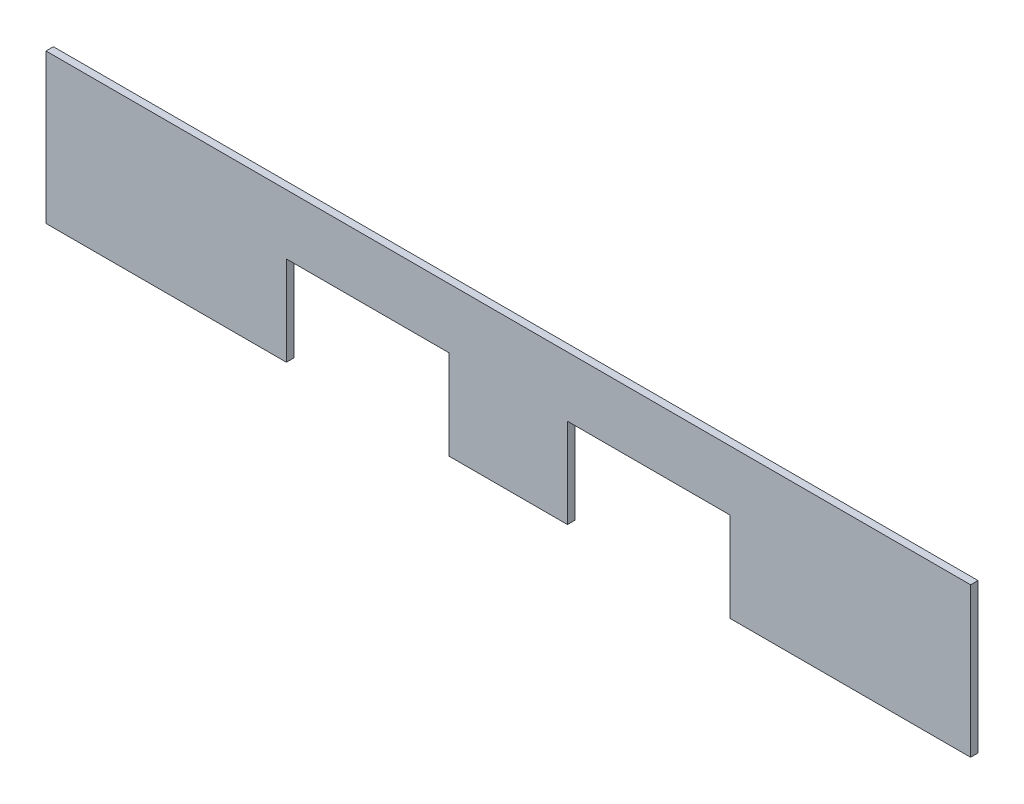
ISO-10303-21;
HEADER;
FILE_DESCRIPTION(('STEP AP214'),'2;1');
FILE_NAME('part.step','',(''),(''),'','','');
FILE_SCHEMA(('AUTOMOTIVE_DESIGN { 1 0 10303 214 1 1 1 1 }'));
ENDSEC;
DATA;
#1=APPLICATION_CONTEXT('core data for automotive mechanical design processes');
#2=APPLICATION_PROTOCOL_DEFINITION('international standard','automotive_design',2000,#1);
#3=PRODUCT_CONTEXT('',#1,'mechanical');
#4=PRODUCT('Part','Part','',(#3));
#5=PRODUCT_RELATED_PRODUCT_CATEGORY('part','',(#4));
#6=PRODUCT_DEFINITION_FORMATION('','',#4);
#7=PRODUCT_DEFINITION_CONTEXT('part definition',#1,'design');
#8=PRODUCT_DEFINITION('design','',#6,#7);
#9=PRODUCT_DEFINITION_SHAPE('','',#8);
#10=(LENGTH_UNIT() NAMED_UNIT(*) SI_UNIT(.MILLI.,.METRE.));
#11=(NAMED_UNIT(*) PLANE_ANGLE_UNIT() SI_UNIT($,.RADIAN.));
#12=(NAMED_UNIT(*) SI_UNIT($,.STERADIAN.) SOLID_ANGLE_UNIT());
#13=UNCERTAINTY_MEASURE_WITH_UNIT(LENGTH_MEASURE(1.E-05),#10,'distance_accuracy_value','');
#14=(GEOMETRIC_REPRESENTATION_CONTEXT(3) GLOBAL_UNCERTAINTY_ASSIGNED_CONTEXT((#13)) GLOBAL_UNIT_ASSIGNED_CONTEXT((#10,
#11,#12)) REPRESENTATION_CONTEXT('',''));
#15=CARTESIAN_POINT('',(0.,0.,0.));
#16=DIRECTION('',(0.,0.,1.));
#17=DIRECTION('',(1.,0.,0.));
#18=AXIS2_PLACEMENT_3D('',#15,#16,#17);
#19=CARTESIAN_POINT('',(625.,200.,200.));
#20=DIRECTION('',(0.,0.,-1.));
#21=DIRECTION('',(-1.,0.,0.));
#22=AXIS2_PLACEMENT_3D('',#19,#20,#21);
#23=PLANE('',#22);
#24=DIRECTION('',(0.,1.,0.));
#25=VECTOR('',#24,1.);
#26=CARTESIAN_POINT('',(-80.,0.,200.));
#27=LINE('',#26,#25);
#28=CARTESIAN_POINT('',(-80.,-1.,200.));
#29=VERTEX_POINT('',#28);
#30=CARTESIAN_POINT('',(-80.,120.,200.));
#31=VERTEX_POINT('',#30);
#32=EDGE_CURVE('E187',#29,#31,#27,.T.);
#33=ORIENTED_EDGE('',*,*,#32,.F.);
#34=DIRECTION('',(-1.,0.,0.));
#35=VECTOR('',#34,1.);
#36=CARTESIAN_POINT('',(80.,-1.,200.));
#37=LINE('',#36,#35);
#38=CARTESIAN_POINT('',(80.,-1.,200.));
#39=VERTEX_POINT('',#38);
#40=EDGE_CURVE('E151',#39,#29,#37,.T.);
#41=ORIENTED_EDGE('',*,*,#40,.F.);
#42=DIRECTION('',(0.,-1.,0.));
#43=VECTOR('',#42,1.);
#44=CARTESIAN_POINT('',(80.,120.,200.));
#45=LINE('',#44,#43);
#46=CARTESIAN_POINT('',(80.,120.,200.));
#47=VERTEX_POINT('',#46);
#48=EDGE_CURVE('E199',#47,#39,#45,.T.);
#49=ORIENTED_EDGE('',*,*,#48,.F.);
#50=DIRECTION('',(-1.,0.,0.));
#51=VECTOR('',#50,1.);
#52=CARTESIAN_POINT('',(300.,120.,200.));
#53=LINE('',#52,#51);
#54=CARTESIAN_POINT('',(300.,120.,200.));
#55=VERTEX_POINT('',#54);
#56=EDGE_CURVE('E197',#55,#47,#53,.T.);
#57=ORIENTED_EDGE('',*,*,#56,.F.);
#58=DIRECTION('',(0.,1.,0.));
#59=VECTOR('',#58,1.);
#60=CARTESIAN_POINT('',(300.,0.,200.));
#61=LINE('',#60,#59);
#62=CARTESIAN_POINT('',(300.,-1.,200.));
#63=VERTEX_POINT('',#62);
#64=EDGE_CURVE('E201',#63,#55,#61,.T.);
#65=ORIENTED_EDGE('',*,*,#64,.F.);
#66=DIRECTION('',(-1.,0.,0.));
#67=VECTOR('',#66,1.);
#68=CARTESIAN_POINT('',(625.,-1.,200.));
#69=LINE('',#68,#67);
#70=CARTESIAN_POINT('',(625.,-1.,200.));
#71=VERTEX_POINT('',#70);
#72=EDGE_CURVE('E163',#71,#63,#69,.T.);
#73=ORIENTED_EDGE('',*,*,#72,.F.);
#74=DIRECTION('',(0.,-1.,0.));
#75=VECTOR('',#74,1.);
#76=CARTESIAN_POINT('',(625.,200.,200.));
#77=LINE('',#76,#75);
#78=CARTESIAN_POINT('',(625.,201.,200.));
#79=VERTEX_POINT('',#78);
#80=EDGE_CURVE('E207',#79,#71,#77,.T.);
#81=ORIENTED_EDGE('',*,*,#80,.F.);
#82=DIRECTION('',(1.,0.,0.));
#83=VECTOR('',#82,1.);
#84=CARTESIAN_POINT('',(-625.,201.,200.));
#85=LINE('',#84,#83);
#86=CARTESIAN_POINT('',(-625.,201.,200.));
#87=VERTEX_POINT('',#86);
#88=EDGE_CURVE('E184',#87,#79,#85,.T.);
#89=ORIENTED_EDGE('',*,*,#88,.F.);
#90=DIRECTION('',(0.,-1.,0.));
#91=VECTOR('',#90,1.);
#92=CARTESIAN_POINT('',(-625.,200.,200.));
#93=LINE('',#92,#91);
#94=CARTESIAN_POINT('',(-625.,-1.,200.));
#95=VERTEX_POINT('',#94);
#96=EDGE_CURVE('E206',#87,#95,#93,.T.);
#97=ORIENTED_EDGE('',*,*,#96,.T.);
#98=DIRECTION('',(-1.,0.,0.));
#99=VECTOR('',#98,1.);
#100=CARTESIAN_POINT('',(-300.,-1.,200.));
#101=LINE('',#100,#99);
#102=CARTESIAN_POINT('',(-300.,-1.,200.));
#103=VERTEX_POINT('',#102);
#104=EDGE_CURVE('E141',#103,#95,#101,.T.);
#105=ORIENTED_EDGE('',*,*,#104,.F.);
#106=DIRECTION('',(0.,-1.,0.));
#107=VECTOR('',#106,1.);
#108=CARTESIAN_POINT('',(-300.,120.,200.));
#109=LINE('',#108,#107);
#110=CARTESIAN_POINT('',(-300.,120.,200.));
#111=VERTEX_POINT('',#110);
#112=EDGE_CURVE('E137',#111,#103,#109,.T.);
#113=ORIENTED_EDGE('',*,*,#112,.F.);
#114=DIRECTION('',(-1.,0.,0.));
#115=VECTOR('',#114,1.);
#116=CARTESIAN_POINT('',(-80.,120.,200.));
#117=LINE('',#116,#115);
#118=EDGE_CURVE('E189',#31,#111,#117,.T.);
#119=ORIENTED_EDGE('',*,*,#118,.F.);
#120=EDGE_LOOP('',(#33,#41,#49,#57,#65,#73,#81,#89,#97,#105,#113,#119));
#121=FACE_BOUND('',#120,.T.);
#122=ADVANCED_FACE('F35',(#121),#23,.F.);
#123=CARTESIAN_POINT('',(625.,190.,190.));
#124=DIRECTION('',(0.,0.,-1.));
#125=DIRECTION('',(-1.,0.,0.));
#126=AXIS2_PLACEMENT_3D('',#123,#124,#125);
#127=PLANE('',#126);
#128=DIRECTION('',(0.,-1.,0.));
#129=VECTOR('',#128,1.);
#130=CARTESIAN_POINT('',(80.,190.,190.));
#131=LINE('',#130,#129);
#132=CARTESIAN_POINT('',(80.,120.,190.));
#133=VERTEX_POINT('',#132);
#134=CARTESIAN_POINT('',(80.,-1.,190.));
#135=VERTEX_POINT('',#134);
#136=EDGE_CURVE('E57',#133,#135,#131,.T.);
#137=ORIENTED_EDGE('',*,*,#136,.T.);
#138=DIRECTION('',(1.,0.,0.));
#139=VECTOR('',#138,1.);
#140=CARTESIAN_POINT('',(-80.,-1.,190.));
#141=LINE('',#140,#139);
#142=CARTESIAN_POINT('',(-80.,-1.,190.));
#143=VERTEX_POINT('',#142);
#144=EDGE_CURVE('E157',#143,#135,#141,.T.);
#145=ORIENTED_EDGE('',*,*,#144,.F.);
#146=DIRECTION('',(0.,1.,0.));
#147=VECTOR('',#146,1.);
#148=CARTESIAN_POINT('',(-80.,190.,190.));
#149=LINE('',#148,#147);
#150=CARTESIAN_POINT('',(-80.,120.,190.));
#151=VERTEX_POINT('',#150);
#152=EDGE_CURVE('E11',#143,#151,#149,.T.);
#153=ORIENTED_EDGE('',*,*,#152,.T.);
#154=DIRECTION('',(-1.,0.,0.));
#155=VECTOR('',#154,1.);
#156=CARTESIAN_POINT('',(625.,120.,190.));
#157=LINE('',#156,#155);
#158=CARTESIAN_POINT('',(-300.,120.,190.));
#159=VERTEX_POINT('',#158);
#160=EDGE_CURVE('E42',#151,#159,#157,.T.);
#161=ORIENTED_EDGE('',*,*,#160,.T.);
#162=DIRECTION('',(0.,-1.,0.));
#163=VECTOR('',#162,1.);
#164=CARTESIAN_POINT('',(-300.,190.,190.));
#165=LINE('',#164,#163);
#166=CARTESIAN_POINT('',(-300.,-1.,190.));
#167=VERTEX_POINT('',#166);
#168=EDGE_CURVE('E124',#159,#167,#165,.T.);
#169=ORIENTED_EDGE('',*,*,#168,.T.);
#170=DIRECTION('',(1.,0.,0.));
#171=VECTOR('',#170,1.);
#172=CARTESIAN_POINT('',(-625.,-1.,190.));
#173=LINE('',#172,#171);
#174=CARTESIAN_POINT('',(-625.,-1.,190.));
#175=VERTEX_POINT('',#174);
#176=EDGE_CURVE('E128',#175,#167,#173,.T.);
#177=ORIENTED_EDGE('',*,*,#176,.F.);
#178=DIRECTION('',(0.,1.,0.));
#179=VECTOR('',#178,1.);
#180=CARTESIAN_POINT('',(-625.,0.,190.));
#181=LINE('',#180,#179);
#182=CARTESIAN_POINT('',(-625.,201.,190.));
#183=VERTEX_POINT('',#182);
#184=EDGE_CURVE('E211',#175,#183,#181,.T.);
#185=ORIENTED_EDGE('',*,*,#184,.T.);
#186=DIRECTION('',(-1.,0.,0.));
#187=VECTOR('',#186,1.);
#188=CARTESIAN_POINT('',(625.,201.,190.));
#189=LINE('',#188,#187);
#190=CARTESIAN_POINT('',(625.,201.,190.));
#191=VERTEX_POINT('',#190);
#192=EDGE_CURVE('E178',#191,#183,#189,.T.);
#193=ORIENTED_EDGE('',*,*,#192,.F.);
#194=DIRECTION('',(0.,1.,0.));
#195=VECTOR('',#194,1.);
#196=CARTESIAN_POINT('',(625.,0.,190.));
#197=LINE('',#196,#195);
#198=CARTESIAN_POINT('',(625.,-1.,190.));
#199=VERTEX_POINT('',#198);
#200=EDGE_CURVE('E209',#199,#191,#197,.T.);
#201=ORIENTED_EDGE('',*,*,#200,.F.);
#202=DIRECTION('',(1.,0.,0.));
#203=VECTOR('',#202,1.);
#204=CARTESIAN_POINT('',(300.,-1.,190.));
#205=LINE('',#204,#203);
#206=CARTESIAN_POINT('',(300.,-1.,190.));
#207=VERTEX_POINT('',#206);
#208=EDGE_CURVE('E169',#207,#199,#205,.T.);
#209=ORIENTED_EDGE('',*,*,#208,.F.);
#210=DIRECTION('',(0.,1.,0.));
#211=VECTOR('',#210,1.);
#212=CARTESIAN_POINT('',(300.,190.,190.));
#213=LINE('',#212,#211);
#214=CARTESIAN_POINT('',(300.,120.,190.));
#215=VERTEX_POINT('',#214);
#216=EDGE_CURVE('E213',#207,#215,#213,.T.);
#217=ORIENTED_EDGE('',*,*,#216,.T.);
#218=DIRECTION('',(-1.,0.,0.));
#219=VECTOR('',#218,1.);
#220=CARTESIAN_POINT('',(625.,120.,190.));
#221=LINE('',#220,#219);
#222=EDGE_CURVE('E217',#215,#133,#221,.T.);
#223=ORIENTED_EDGE('',*,*,#222,.T.);
#224=EDGE_LOOP('',(#137,#145,#153,#161,#169,#177,#185,#193,#201,#209,#217,#223));
#225=FACE_BOUND('',#224,.T.);
#226=ADVANCED_FACE('F126',(#225),#127,.T.);
#227=CARTESIAN_POINT('',(625.,0.,200.));
#228=DIRECTION('',(1.,0.,0.));
#229=DIRECTION('',(0.,0.,-1.));
#230=AXIS2_PLACEMENT_3D('',#227,#228,#229);
#231=PLANE('',#230);
#232=ORIENTED_EDGE('',*,*,#80,.T.);
#233=DIRECTION('',(0.,0.,1.));
#234=VECTOR('',#233,1.);
#235=CARTESIAN_POINT('',(625.,-1.,190.));
#236=LINE('',#235,#234);
#237=EDGE_CURVE('E172',#199,#71,#236,.T.);
#238=ORIENTED_EDGE('',*,*,#237,.F.);
#239=ORIENTED_EDGE('',*,*,#200,.T.);
#240=DIRECTION('',(0.,0.,-1.));
#241=VECTOR('',#240,1.);
#242=CARTESIAN_POINT('',(625.,201.,200.));
#243=LINE('',#242,#241);
#244=EDGE_CURVE('E175',#79,#191,#243,.T.);
#245=ORIENTED_EDGE('',*,*,#244,.F.);
#246=EDGE_LOOP('',(#232,#238,#239,#245));
#247=FACE_BOUND('',#246,.T.);
#248=ADVANCED_FACE('F244',(#247),#231,.T.);
#249=CARTESIAN_POINT('',(-625.,0.,200.));
#250=DIRECTION('',(1.,0.,0.));
#251=DIRECTION('',(0.,0.,-1.));
#252=AXIS2_PLACEMENT_3D('',#249,#250,#251);
#253=PLANE('',#252);
#254=ORIENTED_EDGE('',*,*,#184,.F.);
#255=DIRECTION('',(0.,0.,-1.));
#256=VECTOR('',#255,1.);
#257=CARTESIAN_POINT('',(-625.,-1.,200.));
#258=LINE('',#257,#256);
#259=EDGE_CURVE('E146',#95,#175,#258,.T.);
#260=ORIENTED_EDGE('',*,*,#259,.F.);
#261=ORIENTED_EDGE('',*,*,#96,.F.);
#262=DIRECTION('',(0.,0.,1.));
#263=VECTOR('',#262,1.);
#264=CARTESIAN_POINT('',(-625.,201.,190.));
#265=LINE('',#264,#263);
#266=EDGE_CURVE('E181',#183,#87,#265,.T.);
#267=ORIENTED_EDGE('',*,*,#266,.F.);
#268=EDGE_LOOP('',(#254,#260,#261,#267));
#269=FACE_BOUND('',#268,.T.);
#270=ADVANCED_FACE('F237',(#269),#253,.F.);
#271=CARTESIAN_POINT('',(300.,120.,200.));
#272=DIRECTION('',(0.,-1.,0.));
#273=DIRECTION('',(0.,0.,-1.));
#274=AXIS2_PLACEMENT_3D('',#271,#272,#273);
#275=PLANE('',#274);
#276=DIRECTION('',(0.,0.,-1.));
#277=VECTOR('',#276,1.);
#278=CARTESIAN_POINT('',(300.,120.,200.));
#279=LINE('',#278,#277);
#280=EDGE_CURVE('E49',#55,#215,#279,.T.);
#281=ORIENTED_EDGE('',*,*,#280,.F.);
#282=ORIENTED_EDGE('',*,*,#56,.T.);
#283=DIRECTION('',(0.,0.,-1.));
#284=VECTOR('',#283,1.);
#285=CARTESIAN_POINT('',(80.,120.,200.));
#286=LINE('',#285,#284);
#287=EDGE_CURVE('E204',#47,#133,#286,.T.);
#288=ORIENTED_EDGE('',*,*,#287,.T.);
#289=ORIENTED_EDGE('',*,*,#222,.F.);
#290=EDGE_LOOP('',(#281,#282,#288,#289));
#291=FACE_BOUND('',#290,.T.);
#292=ADVANCED_FACE('F253',(#291),#275,.T.);
#293=CARTESIAN_POINT('',(80.,120.,200.));
#294=DIRECTION('',(1.,0.,0.));
#295=DIRECTION('',(0.,0.,-1.));
#296=AXIS2_PLACEMENT_3D('',#293,#294,#295);
#297=PLANE('',#296);
#298=ORIENTED_EDGE('',*,*,#287,.F.);
#299=ORIENTED_EDGE('',*,*,#48,.T.);
#300=DIRECTION('',(0.,0.,1.));
#301=VECTOR('',#300,1.);
#302=CARTESIAN_POINT('',(80.,-1.,190.));
#303=LINE('',#302,#301);
#304=EDGE_CURVE('E160',#135,#39,#303,.T.);
#305=ORIENTED_EDGE('',*,*,#304,.F.);
#306=ORIENTED_EDGE('',*,*,#136,.F.);
#307=EDGE_LOOP('',(#298,#299,#305,#306));
#308=FACE_BOUND('',#307,.T.);
#309=ADVANCED_FACE('F225',(#308),#297,.T.);
#310=CARTESIAN_POINT('',(300.,0.,200.));
#311=DIRECTION('',(-1.,0.,0.));
#312=DIRECTION('',(0.,0.,1.));
#313=AXIS2_PLACEMENT_3D('',#310,#311,#312);
#314=PLANE('',#313);
#315=ORIENTED_EDGE('',*,*,#216,.F.);
#316=DIRECTION('',(0.,0.,-1.));
#317=VECTOR('',#316,1.);
#318=CARTESIAN_POINT('',(300.,-1.,200.));
#319=LINE('',#318,#317);
#320=EDGE_CURVE('E166',#63,#207,#319,.T.);
#321=ORIENTED_EDGE('',*,*,#320,.F.);
#322=ORIENTED_EDGE('',*,*,#64,.T.);
#323=ORIENTED_EDGE('',*,*,#280,.T.);
#324=EDGE_LOOP('',(#315,#321,#322,#323));
#325=FACE_BOUND('',#324,.T.);
#326=ADVANCED_FACE('F251',(#325),#314,.T.);
#327=CARTESIAN_POINT('',(-80.,0.,200.));
#328=DIRECTION('',(-1.,0.,0.));
#329=DIRECTION('',(0.,0.,1.));
#330=AXIS2_PLACEMENT_3D('',#327,#328,#329);
#331=PLANE('',#330);
#332=ORIENTED_EDGE('',*,*,#152,.F.);
#333=DIRECTION('',(0.,0.,-1.));
#334=VECTOR('',#333,1.);
#335=CARTESIAN_POINT('',(-80.,-1.,200.));
#336=LINE('',#335,#334);
#337=EDGE_CURVE('E154',#29,#143,#336,.T.);
#338=ORIENTED_EDGE('',*,*,#337,.F.);
#339=ORIENTED_EDGE('',*,*,#32,.T.);
#340=DIRECTION('',(0.,0.,-1.));
#341=VECTOR('',#340,1.);
#342=CARTESIAN_POINT('',(-80.,120.,200.));
#343=LINE('',#342,#341);
#344=EDGE_CURVE('E194',#31,#151,#343,.T.);
#345=ORIENTED_EDGE('',*,*,#344,.T.);
#346=EDGE_LOOP('',(#332,#338,#339,#345));
#347=FACE_BOUND('',#346,.T.);
#348=ADVANCED_FACE('F232',(#347),#331,.T.);
#349=CARTESIAN_POINT('',(-80.,120.,200.));
#350=DIRECTION('',(0.,-1.,0.));
#351=DIRECTION('',(0.,0.,-1.));
#352=AXIS2_PLACEMENT_3D('',#349,#350,#351);
#353=PLANE('',#352);
#354=ORIENTED_EDGE('',*,*,#344,.F.);
#355=ORIENTED_EDGE('',*,*,#118,.T.);
#356=DIRECTION('',(0.,0.,-1.));
#357=VECTOR('',#356,1.);
#358=CARTESIAN_POINT('',(-300.,120.,200.));
#359=LINE('',#358,#357);
#360=EDGE_CURVE('E192',#111,#159,#359,.T.);
#361=ORIENTED_EDGE('',*,*,#360,.T.);
#362=ORIENTED_EDGE('',*,*,#160,.F.);
#363=EDGE_LOOP('',(#354,#355,#361,#362));
#364=FACE_BOUND('',#363,.T.);
#365=ADVANCED_FACE('F234',(#364),#353,.T.);
#366=CARTESIAN_POINT('',(-300.,120.,200.));
#367=DIRECTION('',(1.,0.,0.));
#368=DIRECTION('',(0.,0.,-1.));
#369=AXIS2_PLACEMENT_3D('',#366,#367,#368);
#370=PLANE('',#369);
#371=ORIENTED_EDGE('',*,*,#360,.F.);
#372=ORIENTED_EDGE('',*,*,#112,.T.);
#373=DIRECTION('',(0.,0.,1.));
#374=VECTOR('',#373,1.);
#375=CARTESIAN_POINT('',(-300.,-1.,190.));
#376=LINE('',#375,#374);
#377=EDGE_CURVE('E134',#167,#103,#376,.T.);
#378=ORIENTED_EDGE('',*,*,#377,.F.);
#379=ORIENTED_EDGE('',*,*,#168,.F.);
#380=EDGE_LOOP('',(#371,#372,#378,#379));
#381=FACE_BOUND('',#380,.T.);
#382=ADVANCED_FACE('F135',(#381),#370,.T.);
#383=CARTESIAN_POINT('',(625.,201.,190.));
#384=DIRECTION('',(0.,1.,0.));
#385=DIRECTION('',(0.,0.,1.));
#386=AXIS2_PLACEMENT_3D('',#383,#384,#385);
#387=PLANE('',#386);
#388=ORIENTED_EDGE('',*,*,#244,.T.);
#389=ORIENTED_EDGE('',*,*,#192,.T.);
#390=ORIENTED_EDGE('',*,*,#266,.T.);
#391=ORIENTED_EDGE('',*,*,#88,.T.);
#392=EDGE_LOOP('',(#388,#389,#390,#391));
#393=FACE_BOUND('',#392,.T.);
#394=ADVANCED_FACE('F241',(#393),#387,.T.);
#395=CARTESIAN_POINT('',(300.,-1.,200.));
#396=DIRECTION('',(0.,-1.,0.));
#397=DIRECTION('',(0.,0.,-1.));
#398=AXIS2_PLACEMENT_3D('',#395,#396,#397);
#399=PLANE('',#398);
#400=ORIENTED_EDGE('',*,*,#72,.T.);
#401=ORIENTED_EDGE('',*,*,#320,.T.);
#402=ORIENTED_EDGE('',*,*,#208,.T.);
#403=ORIENTED_EDGE('',*,*,#237,.T.);
#404=EDGE_LOOP('',(#400,#401,#402,#403));
#405=FACE_BOUND('',#404,.T.);
#406=ADVANCED_FACE('F248',(#405),#399,.T.);
#407=CARTESIAN_POINT('',(-80.,-1.,200.));
#408=DIRECTION('',(0.,-1.,0.));
#409=DIRECTION('',(0.,0.,-1.));
#410=AXIS2_PLACEMENT_3D('',#407,#408,#409);
#411=PLANE('',#410);
#412=ORIENTED_EDGE('',*,*,#40,.T.);
#413=ORIENTED_EDGE('',*,*,#337,.T.);
#414=ORIENTED_EDGE('',*,*,#144,.T.);
#415=ORIENTED_EDGE('',*,*,#304,.T.);
#416=EDGE_LOOP('',(#412,#413,#414,#415));
#417=FACE_BOUND('',#416,.T.);
#418=ADVANCED_FACE('F222',(#417),#411,.T.);
#419=CARTESIAN_POINT('',(-300.,-1.,190.));
#420=DIRECTION('',(0.,-1.,0.));
#421=DIRECTION('',(0.,0.,-1.));
#422=AXIS2_PLACEMENT_3D('',#419,#420,#421);
#423=PLANE('',#422);
#424=ORIENTED_EDGE('',*,*,#176,.T.);
#425=ORIENTED_EDGE('',*,*,#377,.T.);
#426=ORIENTED_EDGE('',*,*,#104,.T.);
#427=ORIENTED_EDGE('',*,*,#259,.T.);
#428=EDGE_LOOP('',(#424,#425,#426,#427));
#429=FACE_BOUND('',#428,.T.);
#430=ADVANCED_FACE('F144',(#429),#423,.T.);
#431=CLOSED_SHELL('',(#122,#226,#248,#270,#292,#309,#326,#348,#365,#382,#394,#406,#418,#430));
#432=MANIFOLD_SOLID_BREP('B2',#431);
#433=ADVANCED_BREP_SHAPE_REPRESENTATION('',(#18,#432),#14);
#434=SHAPE_DEFINITION_REPRESENTATION(#9,#433);
ENDSEC;
END-ISO-10303-21;
